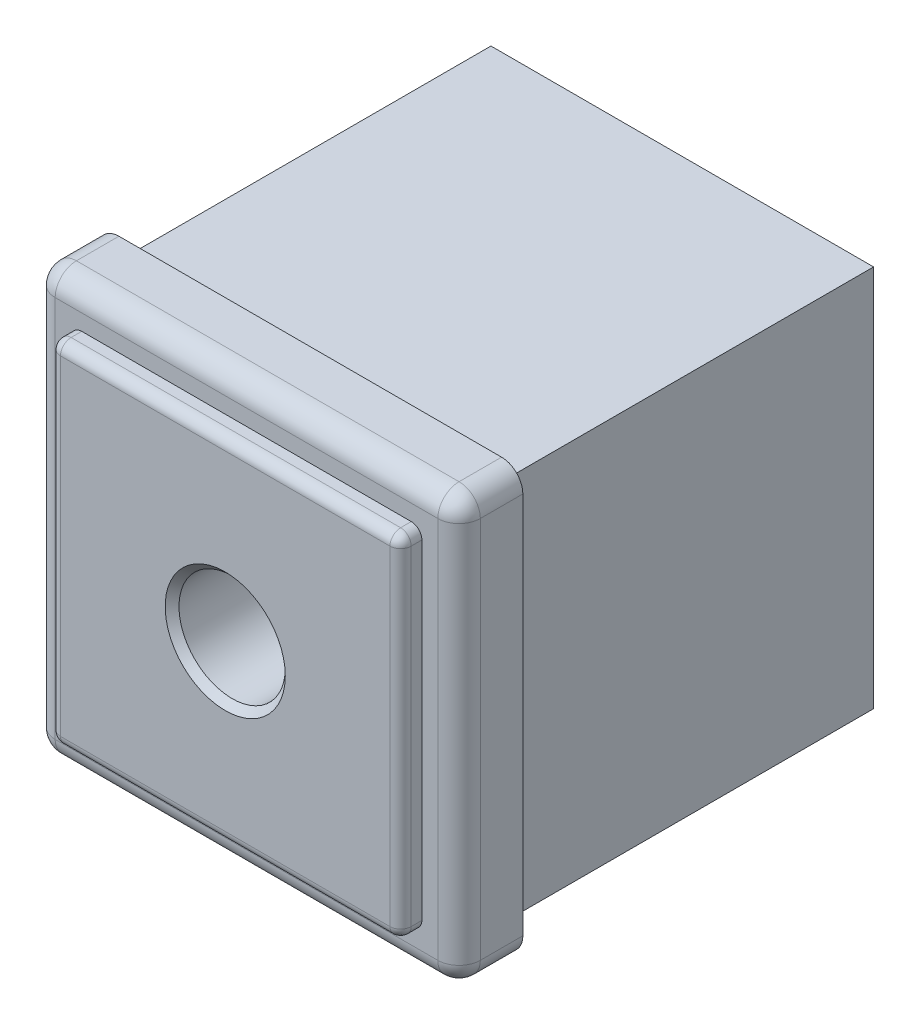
ISO-10303-21;
HEADER;
FILE_DESCRIPTION(('STEP AP214'),'2;1');
FILE_NAME('part.step','',(''),(''),'','','');
FILE_SCHEMA(('AUTOMOTIVE_DESIGN { 1 0 10303 214 1 1 1 1 }'));
ENDSEC;
DATA;
#1=APPLICATION_CONTEXT('core data for automotive mechanical design processes');
#2=APPLICATION_PROTOCOL_DEFINITION('international standard','automotive_design',2000,#1);
#3=PRODUCT_CONTEXT('',#1,'mechanical');
#4=PRODUCT('Part','Part','',(#3));
#5=PRODUCT_RELATED_PRODUCT_CATEGORY('part','',(#4));
#6=PRODUCT_DEFINITION_FORMATION('','',#4);
#7=PRODUCT_DEFINITION_CONTEXT('part definition',#1,'design');
#8=PRODUCT_DEFINITION('design','',#6,#7);
#9=PRODUCT_DEFINITION_SHAPE('','',#8);
#10=(LENGTH_UNIT() NAMED_UNIT(*) SI_UNIT(.MILLI.,.METRE.));
#11=(NAMED_UNIT(*) PLANE_ANGLE_UNIT() SI_UNIT($,.RADIAN.));
#12=(NAMED_UNIT(*) SI_UNIT($,.STERADIAN.) SOLID_ANGLE_UNIT());
#13=UNCERTAINTY_MEASURE_WITH_UNIT(LENGTH_MEASURE(1.E-05),#10,'distance_accuracy_value','');
#14=(GEOMETRIC_REPRESENTATION_CONTEXT(3) GLOBAL_UNCERTAINTY_ASSIGNED_CONTEXT((#13)) GLOBAL_UNIT_ASSIGNED_CONTEXT((#10,
#11,#12)) REPRESENTATION_CONTEXT('',''));
#15=CARTESIAN_POINT('',(0.,0.,0.));
#16=DIRECTION('',(0.,0.,1.));
#17=DIRECTION('',(1.,0.,0.));
#18=AXIS2_PLACEMENT_3D('',#15,#16,#17);
#19=CARTESIAN_POINT('',(20.,-20.,6.));
#20=DIRECTION('',(0.,0.,1.));
#21=DIRECTION('',(1.,0.,0.));
#22=AXIS2_PLACEMENT_3D('',#19,#20,#21);
#23=PLANE('',#22);
#24=DIRECTION('',(0.,1.,0.));
#25=VECTOR('',#24,1.);
#26=CARTESIAN_POINT('',(18.,18.,6.));
#27=LINE('',#26,#25);
#28=CARTESIAN_POINT('',(18.,-18.,6.));
#29=VERTEX_POINT('',#28);
#30=CARTESIAN_POINT('',(18.,18.,6.));
#31=VERTEX_POINT('',#30);
#32=EDGE_CURVE('E344',#29,#31,#27,.T.);
#33=ORIENTED_EDGE('',*,*,#32,.T.);
#34=DIRECTION('',(-1.,0.,0.));
#35=VECTOR('',#34,1.);
#36=CARTESIAN_POINT('',(-18.,18.,6.));
#37=LINE('',#36,#35);
#38=CARTESIAN_POINT('',(-18.,18.,6.));
#39=VERTEX_POINT('',#38);
#40=EDGE_CURVE('E348',#31,#39,#37,.T.);
#41=ORIENTED_EDGE('',*,*,#40,.T.);
#42=DIRECTION('',(0.,-1.,0.));
#43=VECTOR('',#42,1.);
#44=CARTESIAN_POINT('',(-18.,-18.,6.));
#45=LINE('',#44,#43);
#46=CARTESIAN_POINT('',(-18.,-18.,6.));
#47=VERTEX_POINT('',#46);
#48=EDGE_CURVE('E346',#39,#47,#45,.T.);
#49=ORIENTED_EDGE('',*,*,#48,.T.);
#50=DIRECTION('',(1.,0.,0.));
#51=VECTOR('',#50,1.);
#52=CARTESIAN_POINT('',(18.,-18.,6.));
#53=LINE('',#52,#51);
#54=EDGE_CURVE('E342',#47,#29,#53,.T.);
#55=ORIENTED_EDGE('',*,*,#54,.T.);
#56=EDGE_LOOP('',(#33,#41,#49,#55));
#57=FACE_BOUND('',#56,.T.);
#58=DIRECTION('',(1.,0.,0.));
#59=VECTOR('',#58,1.);
#60=CARTESIAN_POINT('',(-16.5,-16.5,6.));
#61=LINE('',#60,#59);
#62=CARTESIAN_POINT('',(-15.5,-16.5,6.));
#63=VERTEX_POINT('',#62);
#64=CARTESIAN_POINT('',(15.5,-16.5,6.));
#65=VERTEX_POINT('',#64);
#66=EDGE_CURVE('E266',#63,#65,#61,.T.);
#67=ORIENTED_EDGE('',*,*,#66,.F.);
#68=CARTESIAN_POINT('',(-15.5,-15.5,6.));
#69=DIRECTION('',(0.,0.,1.));
#70=DIRECTION('',(1.,0.,0.));
#71=AXIS2_PLACEMENT_3D('',#68,#69,#70);
#72=CIRCLE('',#71,1.);
#73=CARTESIAN_POINT('',(-16.5,-15.5,6.));
#74=VERTEX_POINT('',#73);
#75=EDGE_CURVE('E338',#63,#74,#72,.F.);
#76=ORIENTED_EDGE('',*,*,#75,.T.);
#77=DIRECTION('',(0.,-1.,0.));
#78=VECTOR('',#77,1.);
#79=CARTESIAN_POINT('',(-16.5,16.5,6.));
#80=LINE('',#79,#78);
#81=CARTESIAN_POINT('',(-16.5,15.5,6.));
#82=VERTEX_POINT('',#81);
#83=EDGE_CURVE('E263',#82,#74,#80,.T.);
#84=ORIENTED_EDGE('',*,*,#83,.F.);
#85=CARTESIAN_POINT('',(-15.5,15.5,6.));
#86=DIRECTION('',(0.,0.,1.));
#87=DIRECTION('',(1.,0.,0.));
#88=AXIS2_PLACEMENT_3D('',#85,#86,#87);
#89=CIRCLE('',#88,1.);
#90=CARTESIAN_POINT('',(-15.5,16.5,6.));
#91=VERTEX_POINT('',#90);
#92=EDGE_CURVE('E334',#82,#91,#89,.F.);
#93=ORIENTED_EDGE('',*,*,#92,.T.);
#94=DIRECTION('',(-1.,0.,0.));
#95=VECTOR('',#94,1.);
#96=CARTESIAN_POINT('',(-16.5,16.5,6.));
#97=LINE('',#96,#95);
#98=CARTESIAN_POINT('',(15.5,16.5,6.));
#99=VERTEX_POINT('',#98);
#100=EDGE_CURVE('E272',#99,#91,#97,.T.);
#101=ORIENTED_EDGE('',*,*,#100,.F.);
#102=CARTESIAN_POINT('',(15.5,15.5,6.));
#103=DIRECTION('',(0.,0.,1.));
#104=DIRECTION('',(1.,0.,0.));
#105=AXIS2_PLACEMENT_3D('',#102,#103,#104);
#106=CIRCLE('',#105,1.);
#107=CARTESIAN_POINT('',(16.5,15.5,6.));
#108=VERTEX_POINT('',#107);
#109=EDGE_CURVE('E336',#99,#108,#106,.F.);
#110=ORIENTED_EDGE('',*,*,#109,.T.);
#111=DIRECTION('',(0.,1.,0.));
#112=VECTOR('',#111,1.);
#113=CARTESIAN_POINT('',(16.5,16.5,6.));
#114=LINE('',#113,#112);
#115=CARTESIAN_POINT('',(16.5,-15.5,6.));
#116=VERTEX_POINT('',#115);
#117=EDGE_CURVE('E269',#116,#108,#114,.T.);
#118=ORIENTED_EDGE('',*,*,#117,.F.);
#119=CARTESIAN_POINT('',(15.5,-15.5,6.));
#120=DIRECTION('',(0.,0.,1.));
#121=DIRECTION('',(1.,0.,0.));
#122=AXIS2_PLACEMENT_3D('',#119,#120,#121);
#123=CIRCLE('',#122,1.);
#124=EDGE_CURVE('E340',#116,#65,#123,.F.);
#125=ORIENTED_EDGE('',*,*,#124,.T.);
#126=EDGE_LOOP('',(#67,#76,#84,#93,#101,#110,#118,#125));
#127=FACE_BOUND('',#126,.T.);
#128=ADVANCED_FACE('F14',(#57,#127),#23,.T.);
#129=CARTESIAN_POINT('',(-18.25,-18.25,-35.));
#130=DIRECTION('',(0.,0.,1.));
#131=DIRECTION('',(1.,0.,0.));
#132=AXIS2_PLACEMENT_3D('',#129,#130,#131);
#133=PLANE('',#132);
#134=DIRECTION('',(0.,1.,0.));
#135=VECTOR('',#134,1.);
#136=CARTESIAN_POINT('',(-18.,-18.,-35.));
#137=LINE('',#136,#135);
#138=CARTESIAN_POINT('',(-18.,-18.,-35.));
#139=VERTEX_POINT('',#138);
#140=CARTESIAN_POINT('',(-18.,18.,-35.));
#141=VERTEX_POINT('',#140);
#142=EDGE_CURVE('E198',#139,#141,#137,.T.);
#143=ORIENTED_EDGE('',*,*,#142,.T.);
#144=DIRECTION('',(1.,0.,0.));
#145=VECTOR('',#144,1.);
#146=CARTESIAN_POINT('',(-18.,18.,-35.));
#147=LINE('',#146,#145);
#148=CARTESIAN_POINT('',(18.,18.,-35.));
#149=VERTEX_POINT('',#148);
#150=EDGE_CURVE('E29',#141,#149,#147,.T.);
#151=ORIENTED_EDGE('',*,*,#150,.T.);
#152=DIRECTION('',(0.,-1.,0.));
#153=VECTOR('',#152,1.);
#154=CARTESIAN_POINT('',(18.,18.,-35.));
#155=LINE('',#154,#153);
#156=CARTESIAN_POINT('',(18.,-18.,-35.));
#157=VERTEX_POINT('',#156);
#158=EDGE_CURVE('E187',#149,#157,#155,.T.);
#159=ORIENTED_EDGE('',*,*,#158,.T.);
#160=DIRECTION('',(-1.,0.,0.));
#161=VECTOR('',#160,1.);
#162=CARTESIAN_POINT('',(18.,-18.,-35.));
#163=LINE('',#162,#161);
#164=EDGE_CURVE('E192',#157,#139,#163,.T.);
#165=ORIENTED_EDGE('',*,*,#164,.T.);
#166=EDGE_LOOP('',(#143,#151,#159,#165));
#167=FACE_BOUND('',#166,.T.);
#168=CARTESIAN_POINT('',(0.,0.,-35.));
#169=DIRECTION('',(0.,0.,1.));
#170=DIRECTION('',(1.,0.,0.));
#171=AXIS2_PLACEMENT_3D('',#168,#169,#170);
#172=CIRCLE('',#171,5.);
#173=CARTESIAN_POINT('',(5.,0.,-35.));
#174=VERTEX_POINT('',#173);
#175=EDGE_CURVE('E183',#174,#174,#172,.T.);
#176=ORIENTED_EDGE('',*,*,#175,.T.);
#177=EDGE_LOOP('',(#176));
#178=FACE_BOUND('',#177,.T.);
#179=ADVANCED_FACE('F195',(#167,#178),#133,.F.);
#180=CARTESIAN_POINT('',(20.,-20.,0.));
#181=DIRECTION('',(0.,0.,1.));
#182=DIRECTION('',(1.,0.,0.));
#183=AXIS2_PLACEMENT_3D('',#180,#181,#182);
#184=PLANE('',#183);
#185=DIRECTION('',(-1.,0.,0.));
#186=VECTOR('',#185,1.);
#187=CARTESIAN_POINT('',(-20.,20.,0.));
#188=LINE('',#187,#186);
#189=CARTESIAN_POINT('',(18.,20.,0.));
#190=VERTEX_POINT('',#189);
#191=CARTESIAN_POINT('',(-18.,20.,0.));
#192=VERTEX_POINT('',#191);
#193=EDGE_CURVE('E278',#190,#192,#188,.T.);
#194=ORIENTED_EDGE('',*,*,#193,.F.);
#195=CARTESIAN_POINT('',(18.,18.,0.));
#196=DIRECTION('',(0.,0.,1.));
#197=DIRECTION('',(1.,0.,0.));
#198=AXIS2_PLACEMENT_3D('',#195,#196,#197);
#199=CIRCLE('',#198,2.);
#200=CARTESIAN_POINT('',(20.,18.,0.));
#201=VERTEX_POINT('',#200);
#202=EDGE_CURVE('E298',#190,#201,#199,.F.);
#203=ORIENTED_EDGE('',*,*,#202,.T.);
#204=DIRECTION('',(0.,1.,0.));
#205=VECTOR('',#204,1.);
#206=CARTESIAN_POINT('',(20.,20.,0.));
#207=LINE('',#206,#205);
#208=CARTESIAN_POINT('',(20.,-18.,0.));
#209=VERTEX_POINT('',#208);
#210=EDGE_CURVE('E275',#209,#201,#207,.T.);
#211=ORIENTED_EDGE('',*,*,#210,.F.);
#212=CARTESIAN_POINT('',(18.,-18.,0.));
#213=DIRECTION('',(0.,0.,1.));
#214=DIRECTION('',(1.,0.,0.));
#215=AXIS2_PLACEMENT_3D('',#212,#213,#214);
#216=CIRCLE('',#215,2.);
#217=CARTESIAN_POINT('',(18.,-20.,0.));
#218=VERTEX_POINT('',#217);
#219=EDGE_CURVE('E294',#209,#218,#216,.F.);
#220=ORIENTED_EDGE('',*,*,#219,.T.);
#221=DIRECTION('',(1.,0.,0.));
#222=VECTOR('',#221,1.);
#223=CARTESIAN_POINT('',(-20.,-20.,0.));
#224=LINE('',#223,#222);
#225=CARTESIAN_POINT('',(-18.,-20.,0.));
#226=VERTEX_POINT('',#225);
#227=EDGE_CURVE('E284',#226,#218,#224,.T.);
#228=ORIENTED_EDGE('',*,*,#227,.F.);
#229=CARTESIAN_POINT('',(-18.,-18.,0.));
#230=DIRECTION('',(0.,0.,1.));
#231=DIRECTION('',(1.,0.,0.));
#232=AXIS2_PLACEMENT_3D('',#229,#230,#231);
#233=CIRCLE('',#232,2.);
#234=CARTESIAN_POINT('',(-20.,-18.,0.));
#235=VERTEX_POINT('',#234);
#236=EDGE_CURVE('E292',#226,#235,#233,.F.);
#237=ORIENTED_EDGE('',*,*,#236,.T.);
#238=DIRECTION('',(0.,-1.,0.));
#239=VECTOR('',#238,1.);
#240=CARTESIAN_POINT('',(-20.,20.,0.));
#241=LINE('',#240,#239);
#242=CARTESIAN_POINT('',(-20.,18.,0.));
#243=VERTEX_POINT('',#242);
#244=EDGE_CURVE('E281',#243,#235,#241,.T.);
#245=ORIENTED_EDGE('',*,*,#244,.F.);
#246=CARTESIAN_POINT('',(-18.,18.,0.));
#247=DIRECTION('',(0.,0.,1.));
#248=DIRECTION('',(1.,0.,0.));
#249=AXIS2_PLACEMENT_3D('',#246,#247,#248);
#250=CIRCLE('',#249,2.);
#251=EDGE_CURVE('E296',#243,#192,#250,.F.);
#252=ORIENTED_EDGE('',*,*,#251,.T.);
#253=EDGE_LOOP('',(#194,#203,#211,#220,#228,#237,#245,#252));
#254=FACE_BOUND('',#253,.T.);
#255=DIRECTION('',(1.,0.,0.));
#256=VECTOR('',#255,1.);
#257=CARTESIAN_POINT('',(-18.,18.,0.));
#258=LINE('',#257,#256);
#259=CARTESIAN_POINT('',(-18.,18.,0.));
#260=VERTEX_POINT('',#259);
#261=CARTESIAN_POINT('',(18.,18.,0.));
#262=VERTEX_POINT('',#261);
#263=EDGE_CURVE('E180',#260,#262,#258,.T.);
#264=ORIENTED_EDGE('',*,*,#263,.F.);
#265=DIRECTION('',(0.,1.,0.));
#266=VECTOR('',#265,1.);
#267=CARTESIAN_POINT('',(-18.,-18.,0.));
#268=LINE('',#267,#266);
#269=CARTESIAN_POINT('',(-18.,-18.,0.));
#270=VERTEX_POINT('',#269);
#271=EDGE_CURVE('E199',#270,#260,#268,.T.);
#272=ORIENTED_EDGE('',*,*,#271,.F.);
#273=DIRECTION('',(-1.,0.,0.));
#274=VECTOR('',#273,1.);
#275=CARTESIAN_POINT('',(18.,-18.,0.));
#276=LINE('',#275,#274);
#277=CARTESIAN_POINT('',(18.,-18.,0.));
#278=VERTEX_POINT('',#277);
#279=EDGE_CURVE('E202',#278,#270,#276,.T.);
#280=ORIENTED_EDGE('',*,*,#279,.F.);
#281=DIRECTION('',(0.,-1.,0.));
#282=VECTOR('',#281,1.);
#283=CARTESIAN_POINT('',(18.,18.,0.));
#284=LINE('',#283,#282);
#285=EDGE_CURVE('E209',#262,#278,#284,.T.);
#286=ORIENTED_EDGE('',*,*,#285,.F.);
#287=EDGE_LOOP('',(#264,#272,#280,#286));
#288=FACE_BOUND('',#287,.T.);
#289=ADVANCED_FACE('F417',(#254,#288),#184,.F.);
#290=CARTESIAN_POINT('',(20.,20.,6.));
#291=DIRECTION('',(-1.,0.,0.));
#292=DIRECTION('',(0.,-1.,0.));
#293=AXIS2_PLACEMENT_3D('',#290,#291,#292);
#294=PLANE('',#293);
#295=DIRECTION('',(0.,0.,-1.));
#296=VECTOR('',#295,1.);
#297=CARTESIAN_POINT('',(20.,18.,6.));
#298=LINE('',#297,#296);
#299=CARTESIAN_POINT('',(20.,18.,4.));
#300=VERTEX_POINT('',#299);
#301=EDGE_CURVE('E302',#201,#300,#298,.F.);
#302=ORIENTED_EDGE('',*,*,#301,.T.);
#303=DIRECTION('',(0.,1.,0.));
#304=VECTOR('',#303,1.);
#305=CARTESIAN_POINT('',(20.,-18.,4.));
#306=LINE('',#305,#304);
#307=CARTESIAN_POINT('',(20.,-18.,4.));
#308=VERTEX_POINT('',#307);
#309=EDGE_CURVE('E360',#300,#308,#306,.F.);
#310=ORIENTED_EDGE('',*,*,#309,.T.);
#311=DIRECTION('',(0.,0.,-1.));
#312=VECTOR('',#311,1.);
#313=CARTESIAN_POINT('',(20.,-18.,6.));
#314=LINE('',#313,#312);
#315=EDGE_CURVE('E300',#308,#209,#314,.T.);
#316=ORIENTED_EDGE('',*,*,#315,.T.);
#317=ORIENTED_EDGE('',*,*,#210,.T.);
#318=EDGE_LOOP('',(#302,#310,#316,#317));
#319=FACE_BOUND('',#318,.T.);
#320=ADVANCED_FACE('F434',(#319),#294,.F.);
#321=CARTESIAN_POINT('',(-20.,20.,6.));
#322=DIRECTION('',(0.,-1.,0.));
#323=DIRECTION('',(0.,0.,-1.));
#324=AXIS2_PLACEMENT_3D('',#321,#322,#323);
#325=PLANE('',#324);
#326=DIRECTION('',(0.,0.,-1.));
#327=VECTOR('',#326,1.);
#328=CARTESIAN_POINT('',(-18.,20.,6.));
#329=LINE('',#328,#327);
#330=CARTESIAN_POINT('',(-18.,20.,4.));
#331=VERTEX_POINT('',#330);
#332=EDGE_CURVE('E287',#192,#331,#329,.F.);
#333=ORIENTED_EDGE('',*,*,#332,.T.);
#334=DIRECTION('',(-1.,0.,0.));
#335=VECTOR('',#334,1.);
#336=CARTESIAN_POINT('',(18.,20.,4.));
#337=LINE('',#336,#335);
#338=CARTESIAN_POINT('',(18.,20.,4.));
#339=VERTEX_POINT('',#338);
#340=EDGE_CURVE('E351',#331,#339,#337,.F.);
#341=ORIENTED_EDGE('',*,*,#340,.T.);
#342=DIRECTION('',(0.,0.,-1.));
#343=VECTOR('',#342,1.);
#344=CARTESIAN_POINT('',(18.,20.,6.));
#345=LINE('',#344,#343);
#346=EDGE_CURVE('E290',#339,#190,#345,.T.);
#347=ORIENTED_EDGE('',*,*,#346,.T.);
#348=ORIENTED_EDGE('',*,*,#193,.T.);
#349=EDGE_LOOP('',(#333,#341,#347,#348));
#350=FACE_BOUND('',#349,.T.);
#351=ADVANCED_FACE('F430',(#350),#325,.F.);
#352=CARTESIAN_POINT('',(-20.,20.,6.));
#353=DIRECTION('',(1.,0.,0.));
#354=DIRECTION('',(0.,0.,-1.));
#355=AXIS2_PLACEMENT_3D('',#352,#353,#354);
#356=PLANE('',#355);
#357=DIRECTION('',(0.,0.,-1.));
#358=VECTOR('',#357,1.);
#359=CARTESIAN_POINT('',(-20.,-18.,6.));
#360=LINE('',#359,#358);
#361=CARTESIAN_POINT('',(-20.,-18.,4.));
#362=VERTEX_POINT('',#361);
#363=EDGE_CURVE('E305',#235,#362,#360,.F.);
#364=ORIENTED_EDGE('',*,*,#363,.T.);
#365=DIRECTION('',(0.,-1.,0.));
#366=VECTOR('',#365,1.);
#367=CARTESIAN_POINT('',(-20.,18.,4.));
#368=LINE('',#367,#366);
#369=CARTESIAN_POINT('',(-20.,18.,4.));
#370=VERTEX_POINT('',#369);
#371=EDGE_CURVE('E358',#362,#370,#368,.F.);
#372=ORIENTED_EDGE('',*,*,#371,.T.);
#373=DIRECTION('',(0.,0.,-1.));
#374=VECTOR('',#373,1.);
#375=CARTESIAN_POINT('',(-20.,18.,6.));
#376=LINE('',#375,#374);
#377=EDGE_CURVE('E308',#370,#243,#376,.T.);
#378=ORIENTED_EDGE('',*,*,#377,.T.);
#379=ORIENTED_EDGE('',*,*,#244,.T.);
#380=EDGE_LOOP('',(#364,#372,#378,#379));
#381=FACE_BOUND('',#380,.T.);
#382=ADVANCED_FACE('F426',(#381),#356,.F.);
#383=CARTESIAN_POINT('',(-20.,-20.,6.));
#384=DIRECTION('',(0.,1.,0.));
#385=DIRECTION('',(0.,0.,1.));
#386=AXIS2_PLACEMENT_3D('',#383,#384,#385);
#387=PLANE('',#386);
#388=DIRECTION('',(0.,0.,-1.));
#389=VECTOR('',#388,1.);
#390=CARTESIAN_POINT('',(18.,-20.,6.));
#391=LINE('',#390,#389);
#392=CARTESIAN_POINT('',(18.,-20.,4.));
#393=VERTEX_POINT('',#392);
#394=EDGE_CURVE('E312',#218,#393,#391,.F.);
#395=ORIENTED_EDGE('',*,*,#394,.T.);
#396=DIRECTION('',(1.,0.,0.));
#397=VECTOR('',#396,1.);
#398=CARTESIAN_POINT('',(-18.,-20.,4.));
#399=LINE('',#398,#397);
#400=CARTESIAN_POINT('',(-18.,-20.,4.));
#401=VERTEX_POINT('',#400);
#402=EDGE_CURVE('E366',#393,#401,#399,.F.);
#403=ORIENTED_EDGE('',*,*,#402,.T.);
#404=DIRECTION('',(0.,0.,-1.));
#405=VECTOR('',#404,1.);
#406=CARTESIAN_POINT('',(-18.,-20.,6.));
#407=LINE('',#406,#405);
#408=EDGE_CURVE('E310',#401,#226,#407,.T.);
#409=ORIENTED_EDGE('',*,*,#408,.T.);
#410=ORIENTED_EDGE('',*,*,#227,.T.);
#411=EDGE_LOOP('',(#395,#403,#409,#410));
#412=FACE_BOUND('',#411,.T.);
#413=ADVANCED_FACE('F422',(#412),#387,.F.);
#414=CARTESIAN_POINT('',(-16.5,16.5,8.));
#415=DIRECTION('',(1.,0.,0.));
#416=DIRECTION('',(0.,1.,0.));
#417=AXIS2_PLACEMENT_3D('',#414,#415,#416);
#418=PLANE('',#417);
#419=DIRECTION('',(0.,0.,-1.));
#420=VECTOR('',#419,1.);
#421=CARTESIAN_POINT('',(-16.5,-15.5,8.));
#422=LINE('',#421,#420);
#423=CARTESIAN_POINT('',(-16.5,-15.5,7.));
#424=VERTEX_POINT('',#423);
#425=EDGE_CURVE('E315',#74,#424,#422,.F.);
#426=ORIENTED_EDGE('',*,*,#425,.T.);
#427=DIRECTION('',(0.,-1.,0.));
#428=VECTOR('',#427,1.);
#429=CARTESIAN_POINT('',(-16.5,15.5,7.));
#430=LINE('',#429,#428);
#431=CARTESIAN_POINT('',(-16.5,15.5,7.));
#432=VERTEX_POINT('',#431);
#433=EDGE_CURVE('E377',#424,#432,#430,.F.);
#434=ORIENTED_EDGE('',*,*,#433,.T.);
#435=DIRECTION('',(0.,0.,-1.));
#436=VECTOR('',#435,1.);
#437=CARTESIAN_POINT('',(-16.5,15.5,8.));
#438=LINE('',#437,#436);
#439=EDGE_CURVE('E318',#432,#82,#438,.T.);
#440=ORIENTED_EDGE('',*,*,#439,.T.);
#441=ORIENTED_EDGE('',*,*,#83,.T.);
#442=EDGE_LOOP('',(#426,#434,#440,#441));
#443=FACE_BOUND('',#442,.T.);
#444=ADVANCED_FACE('F425',(#443),#418,.F.);
#445=CARTESIAN_POINT('',(-16.5,-16.5,8.));
#446=DIRECTION('',(0.,1.,0.));
#447=DIRECTION('',(-1.,0.,0.));
#448=AXIS2_PLACEMENT_3D('',#445,#446,#447);
#449=PLANE('',#448);
#450=DIRECTION('',(0.,0.,-1.));
#451=VECTOR('',#450,1.);
#452=CARTESIAN_POINT('',(15.5,-16.5,8.));
#453=LINE('',#452,#451);
#454=CARTESIAN_POINT('',(15.5,-16.5,7.));
#455=VERTEX_POINT('',#454);
#456=EDGE_CURVE('E329',#65,#455,#453,.F.);
#457=ORIENTED_EDGE('',*,*,#456,.T.);
#458=DIRECTION('',(1.,0.,0.));
#459=VECTOR('',#458,1.);
#460=CARTESIAN_POINT('',(-15.5,-16.5,7.));
#461=LINE('',#460,#459);
#462=CARTESIAN_POINT('',(-15.5,-16.5,7.));
#463=VERTEX_POINT('',#462);
#464=EDGE_CURVE('E384',#455,#463,#461,.F.);
#465=ORIENTED_EDGE('',*,*,#464,.T.);
#466=DIRECTION('',(0.,0.,-1.));
#467=VECTOR('',#466,1.);
#468=CARTESIAN_POINT('',(-15.5,-16.5,8.));
#469=LINE('',#468,#467);
#470=EDGE_CURVE('E332',#463,#63,#469,.T.);
#471=ORIENTED_EDGE('',*,*,#470,.T.);
#472=ORIENTED_EDGE('',*,*,#66,.T.);
#473=EDGE_LOOP('',(#457,#465,#471,#472));
#474=FACE_BOUND('',#473,.T.);
#475=ADVANCED_FACE('F526',(#474),#449,.F.);
#476=CARTESIAN_POINT('',(16.5,16.5,8.));
#477=DIRECTION('',(-1.,0.,0.));
#478=DIRECTION('',(0.,0.,1.));
#479=AXIS2_PLACEMENT_3D('',#476,#477,#478);
#480=PLANE('',#479);
#481=DIRECTION('',(0.,0.,-1.));
#482=VECTOR('',#481,1.);
#483=CARTESIAN_POINT('',(16.5,15.5,8.));
#484=LINE('',#483,#482);
#485=CARTESIAN_POINT('',(16.5,15.5,7.));
#486=VERTEX_POINT('',#485);
#487=EDGE_CURVE('E327',#108,#486,#484,.F.);
#488=ORIENTED_EDGE('',*,*,#487,.T.);
#489=DIRECTION('',(0.,1.,0.));
#490=VECTOR('',#489,1.);
#491=CARTESIAN_POINT('',(16.5,-15.5,7.));
#492=LINE('',#491,#490);
#493=CARTESIAN_POINT('',(16.5,-15.5,7.));
#494=VERTEX_POINT('',#493);
#495=EDGE_CURVE('E391',#486,#494,#492,.F.);
#496=ORIENTED_EDGE('',*,*,#495,.T.);
#497=DIRECTION('',(0.,0.,-1.));
#498=VECTOR('',#497,1.);
#499=CARTESIAN_POINT('',(16.5,-15.5,8.));
#500=LINE('',#499,#498);
#501=EDGE_CURVE('E325',#494,#116,#500,.T.);
#502=ORIENTED_EDGE('',*,*,#501,.T.);
#503=ORIENTED_EDGE('',*,*,#117,.T.);
#504=EDGE_LOOP('',(#488,#496,#502,#503));
#505=FACE_BOUND('',#504,.T.);
#506=ADVANCED_FACE('F522',(#505),#480,.F.);
#507=CARTESIAN_POINT('',(-16.5,16.5,8.));
#508=DIRECTION('',(0.,-1.,0.));
#509=DIRECTION('',(1.,0.,0.));
#510=AXIS2_PLACEMENT_3D('',#507,#508,#509);
#511=PLANE('',#510);
#512=DIRECTION('',(0.,0.,-1.));
#513=VECTOR('',#512,1.);
#514=CARTESIAN_POINT('',(-15.5,16.5,8.));
#515=LINE('',#514,#513);
#516=CARTESIAN_POINT('',(-15.5,16.5,7.));
#517=VERTEX_POINT('',#516);
#518=EDGE_CURVE('E322',#91,#517,#515,.F.);
#519=ORIENTED_EDGE('',*,*,#518,.T.);
#520=DIRECTION('',(-1.,0.,0.));
#521=VECTOR('',#520,1.);
#522=CARTESIAN_POINT('',(15.5,16.5,7.));
#523=LINE('',#522,#521);
#524=CARTESIAN_POINT('',(15.5,16.5,7.));
#525=VERTEX_POINT('',#524);
#526=EDGE_CURVE('E386',#517,#525,#523,.F.);
#527=ORIENTED_EDGE('',*,*,#526,.T.);
#528=DIRECTION('',(0.,0.,-1.));
#529=VECTOR('',#528,1.);
#530=CARTESIAN_POINT('',(15.5,16.5,8.));
#531=LINE('',#530,#529);
#532=EDGE_CURVE('E320',#525,#99,#531,.T.);
#533=ORIENTED_EDGE('',*,*,#532,.T.);
#534=ORIENTED_EDGE('',*,*,#100,.T.);
#535=EDGE_LOOP('',(#519,#527,#533,#534));
#536=FACE_BOUND('',#535,.T.);
#537=ADVANCED_FACE('F518',(#536),#511,.F.);
#538=CARTESIAN_POINT('',(-16.5,-16.5,8.));
#539=DIRECTION('',(0.,0.,1.));
#540=DIRECTION('',(1.,0.,0.));
#541=AXIS2_PLACEMENT_3D('',#538,#539,#540);
#542=PLANE('',#541);
#543=CARTESIAN_POINT('',(0.,0.,8.));
#544=DIRECTION('',(0.,0.,1.));
#545=DIRECTION('',(1.,0.,0.));
#546=AXIS2_PLACEMENT_3D('',#543,#544,#545);
#547=CIRCLE('',#546,5.65);
#548=CARTESIAN_POINT('',(5.65,0.,8.));
#549=VERTEX_POINT('',#548);
#550=EDGE_CURVE('E9',#549,#549,#547,.F.);
#551=ORIENTED_EDGE('',*,*,#550,.T.);
#552=EDGE_LOOP('',(#551));
#553=FACE_BOUND('',#552,.T.);
#554=DIRECTION('',(-1.,0.,0.));
#555=VECTOR('',#554,1.);
#556=CARTESIAN_POINT('',(-15.5,15.5,8.));
#557=LINE('',#556,#555);
#558=CARTESIAN_POINT('',(15.5,15.5,8.));
#559=VERTEX_POINT('',#558);
#560=CARTESIAN_POINT('',(-15.5,15.5,8.));
#561=VERTEX_POINT('',#560);
#562=EDGE_CURVE('E370',#559,#561,#557,.T.);
#563=ORIENTED_EDGE('',*,*,#562,.T.);
#564=DIRECTION('',(0.,-1.,0.));
#565=VECTOR('',#564,1.);
#566=CARTESIAN_POINT('',(-15.5,-15.5,8.));
#567=LINE('',#566,#565);
#568=CARTESIAN_POINT('',(-15.5,-15.5,8.));
#569=VERTEX_POINT('',#568);
#570=EDGE_CURVE('E374',#561,#569,#567,.T.);
#571=ORIENTED_EDGE('',*,*,#570,.T.);
#572=DIRECTION('',(1.,0.,0.));
#573=VECTOR('',#572,1.);
#574=CARTESIAN_POINT('',(15.5,-15.5,8.));
#575=LINE('',#574,#573);
#576=CARTESIAN_POINT('',(15.5,-15.5,8.));
#577=VERTEX_POINT('',#576);
#578=EDGE_CURVE('E372',#569,#577,#575,.T.);
#579=ORIENTED_EDGE('',*,*,#578,.T.);
#580=DIRECTION('',(0.,1.,0.));
#581=VECTOR('',#580,1.);
#582=CARTESIAN_POINT('',(15.5,15.5,8.));
#583=LINE('',#582,#581);
#584=EDGE_CURVE('E368',#577,#559,#583,.T.);
#585=ORIENTED_EDGE('',*,*,#584,.T.);
#586=EDGE_LOOP('',(#563,#571,#579,#585));
#587=FACE_BOUND('',#586,.T.);
#588=ADVANCED_FACE('F512',(#553,#587),#542,.T.);
#589=CARTESIAN_POINT('',(18.,18.,6.));
#590=DIRECTION('',(0.,0.,-1.));
#591=DIRECTION('',(-1.,0.,0.));
#592=AXIS2_PLACEMENT_3D('',#589,#590,#591);
#593=CYLINDRICAL_SURFACE('',#592,2.);
#594=ORIENTED_EDGE('',*,*,#346,.F.);
#595=CARTESIAN_POINT('',(18.,18.,4.));
#596=DIRECTION('',(0.,0.,-1.));
#597=DIRECTION('',(-1.,0.,0.));
#598=AXIS2_PLACEMENT_3D('',#595,#596,#597);
#599=CIRCLE('',#598,2.);
#600=EDGE_CURVE('E356',#339,#300,#599,.T.);
#601=ORIENTED_EDGE('',*,*,#600,.T.);
#602=ORIENTED_EDGE('',*,*,#301,.F.);
#603=ORIENTED_EDGE('',*,*,#202,.F.);
#604=EDGE_LOOP('',(#594,#601,#602,#603));
#605=FACE_BOUND('',#604,.T.);
#606=ADVANCED_FACE('F484',(#605),#593,.T.);
#607=CARTESIAN_POINT('',(-18.,18.,6.));
#608=DIRECTION('',(0.,0.,-1.));
#609=DIRECTION('',(-1.,0.,0.));
#610=AXIS2_PLACEMENT_3D('',#607,#608,#609);
#611=CYLINDRICAL_SURFACE('',#610,2.);
#612=ORIENTED_EDGE('',*,*,#377,.F.);
#613=CARTESIAN_POINT('',(-18.,18.,4.));
#614=DIRECTION('',(0.,0.,-1.));
#615=DIRECTION('',(-1.,0.,0.));
#616=AXIS2_PLACEMENT_3D('',#613,#614,#615);
#617=CIRCLE('',#616,2.);
#618=EDGE_CURVE('E354',#370,#331,#617,.T.);
#619=ORIENTED_EDGE('',*,*,#618,.T.);
#620=ORIENTED_EDGE('',*,*,#332,.F.);
#621=ORIENTED_EDGE('',*,*,#251,.F.);
#622=EDGE_LOOP('',(#612,#619,#620,#621));
#623=FACE_BOUND('',#622,.T.);
#624=ADVANCED_FACE('F503',(#623),#611,.T.);
#625=CARTESIAN_POINT('',(18.,-18.,6.));
#626=DIRECTION('',(0.,0.,-1.));
#627=DIRECTION('',(-1.,0.,0.));
#628=AXIS2_PLACEMENT_3D('',#625,#626,#627);
#629=CYLINDRICAL_SURFACE('',#628,2.);
#630=ORIENTED_EDGE('',*,*,#315,.F.);
#631=CARTESIAN_POINT('',(18.,-18.,4.));
#632=DIRECTION('',(0.,0.,-1.));
#633=DIRECTION('',(-1.,0.,0.));
#634=AXIS2_PLACEMENT_3D('',#631,#632,#633);
#635=CIRCLE('',#634,2.);
#636=EDGE_CURVE('E364',#308,#393,#635,.T.);
#637=ORIENTED_EDGE('',*,*,#636,.T.);
#638=ORIENTED_EDGE('',*,*,#394,.F.);
#639=ORIENTED_EDGE('',*,*,#219,.F.);
#640=EDGE_LOOP('',(#630,#637,#638,#639));
#641=FACE_BOUND('',#640,.T.);
#642=ADVANCED_FACE('F475',(#641),#629,.T.);
#643=CARTESIAN_POINT('',(-18.,-18.,6.));
#644=DIRECTION('',(0.,0.,-1.));
#645=DIRECTION('',(-1.,0.,0.));
#646=AXIS2_PLACEMENT_3D('',#643,#644,#645);
#647=CYLINDRICAL_SURFACE('',#646,2.);
#648=ORIENTED_EDGE('',*,*,#408,.F.);
#649=CARTESIAN_POINT('',(-18.,-18.,4.));
#650=DIRECTION('',(0.,0.,-1.));
#651=DIRECTION('',(-1.,0.,0.));
#652=AXIS2_PLACEMENT_3D('',#649,#650,#651);
#653=CIRCLE('',#652,2.);
#654=EDGE_CURVE('E362',#401,#362,#653,.T.);
#655=ORIENTED_EDGE('',*,*,#654,.T.);
#656=ORIENTED_EDGE('',*,*,#363,.F.);
#657=ORIENTED_EDGE('',*,*,#236,.F.);
#658=EDGE_LOOP('',(#648,#655,#656,#657));
#659=FACE_BOUND('',#658,.T.);
#660=ADVANCED_FACE('F499',(#659),#647,.T.);
#661=CARTESIAN_POINT('',(-15.5,15.5,8.));
#662=DIRECTION('',(0.,0.,-1.));
#663=DIRECTION('',(-1.,0.,0.));
#664=AXIS2_PLACEMENT_3D('',#661,#662,#663);
#665=CYLINDRICAL_SURFACE('',#664,1.);
#666=ORIENTED_EDGE('',*,*,#439,.F.);
#667=CARTESIAN_POINT('',(-15.5,15.5,7.));
#668=DIRECTION('',(0.,0.,-1.));
#669=DIRECTION('',(-1.,0.,0.));
#670=AXIS2_PLACEMENT_3D('',#667,#668,#669);
#671=CIRCLE('',#670,1.);
#672=EDGE_CURVE('E382',#432,#517,#671,.T.);
#673=ORIENTED_EDGE('',*,*,#672,.T.);
#674=ORIENTED_EDGE('',*,*,#518,.F.);
#675=ORIENTED_EDGE('',*,*,#92,.F.);
#676=EDGE_LOOP('',(#666,#673,#674,#675));
#677=FACE_BOUND('',#676,.T.);
#678=ADVANCED_FACE('F567',(#677),#665,.T.);
#679=CARTESIAN_POINT('',(15.5,15.5,8.));
#680=DIRECTION('',(0.,0.,-1.));
#681=DIRECTION('',(-1.,0.,0.));
#682=AXIS2_PLACEMENT_3D('',#679,#680,#681);
#683=CYLINDRICAL_SURFACE('',#682,1.);
#684=ORIENTED_EDGE('',*,*,#532,.F.);
#685=CARTESIAN_POINT('',(15.5,15.5,7.));
#686=DIRECTION('',(0.,0.,-1.));
#687=DIRECTION('',(-1.,0.,0.));
#688=AXIS2_PLACEMENT_3D('',#685,#686,#687);
#689=CIRCLE('',#688,1.);
#690=EDGE_CURVE('E37',#525,#486,#689,.T.);
#691=ORIENTED_EDGE('',*,*,#690,.T.);
#692=ORIENTED_EDGE('',*,*,#487,.F.);
#693=ORIENTED_EDGE('',*,*,#109,.F.);
#694=EDGE_LOOP('',(#684,#691,#692,#693));
#695=FACE_BOUND('',#694,.T.);
#696=ADVANCED_FACE('F620',(#695),#683,.T.);
#697=CARTESIAN_POINT('',(-15.5,-15.5,8.));
#698=DIRECTION('',(0.,0.,-1.));
#699=DIRECTION('',(-1.,0.,0.));
#700=AXIS2_PLACEMENT_3D('',#697,#698,#699);
#701=CYLINDRICAL_SURFACE('',#700,1.);
#702=ORIENTED_EDGE('',*,*,#470,.F.);
#703=CARTESIAN_POINT('',(-15.5,-15.5,7.));
#704=DIRECTION('',(0.,0.,-1.));
#705=DIRECTION('',(-1.,0.,0.));
#706=AXIS2_PLACEMENT_3D('',#703,#704,#705);
#707=CIRCLE('',#706,1.);
#708=EDGE_CURVE('E380',#463,#424,#707,.T.);
#709=ORIENTED_EDGE('',*,*,#708,.T.);
#710=ORIENTED_EDGE('',*,*,#425,.F.);
#711=ORIENTED_EDGE('',*,*,#75,.F.);
#712=EDGE_LOOP('',(#702,#709,#710,#711));
#713=FACE_BOUND('',#712,.T.);
#714=ADVANCED_FACE('F574',(#713),#701,.T.);
#715=CARTESIAN_POINT('',(15.5,-15.5,8.));
#716=DIRECTION('',(0.,0.,-1.));
#717=DIRECTION('',(-1.,0.,0.));
#718=AXIS2_PLACEMENT_3D('',#715,#716,#717);
#719=CYLINDRICAL_SURFACE('',#718,1.);
#720=ORIENTED_EDGE('',*,*,#501,.F.);
#721=CARTESIAN_POINT('',(15.5,-15.5,7.));
#722=DIRECTION('',(0.,0.,-1.));
#723=DIRECTION('',(-1.,0.,0.));
#724=AXIS2_PLACEMENT_3D('',#721,#722,#723);
#725=CIRCLE('',#724,1.);
#726=EDGE_CURVE('E388',#494,#455,#725,.T.);
#727=ORIENTED_EDGE('',*,*,#726,.T.);
#728=ORIENTED_EDGE('',*,*,#456,.F.);
#729=ORIENTED_EDGE('',*,*,#124,.F.);
#730=EDGE_LOOP('',(#720,#727,#728,#729));
#731=FACE_BOUND('',#730,.T.);
#732=ADVANCED_FACE('F615',(#731),#719,.T.);
#733=CARTESIAN_POINT('',(20.,-18.,4.));
#734=DIRECTION('',(-1.,0.,0.));
#735=DIRECTION('',(0.,0.,1.));
#736=AXIS2_PLACEMENT_3D('',#733,#734,#735);
#737=CYLINDRICAL_SURFACE('',#736,2.);
#738=CARTESIAN_POINT('',(-18.,-18.,4.));
#739=DIRECTION('',(-1.,0.,0.));
#740=DIRECTION('',(0.,0.,1.));
#741=AXIS2_PLACEMENT_3D('',#738,#739,#740);
#742=CIRCLE('',#741,2.);
#743=EDGE_CURVE('E257',#401,#47,#742,.T.);
#744=ORIENTED_EDGE('',*,*,#743,.F.);
#745=ORIENTED_EDGE('',*,*,#402,.F.);
#746=CARTESIAN_POINT('',(18.,-18.,4.));
#747=DIRECTION('',(1.,0.,0.));
#748=DIRECTION('',(0.,0.,-1.));
#749=AXIS2_PLACEMENT_3D('',#746,#747,#748);
#750=CIRCLE('',#749,2.);
#751=EDGE_CURVE('E260',#29,#393,#750,.T.);
#752=ORIENTED_EDGE('',*,*,#751,.F.);
#753=ORIENTED_EDGE('',*,*,#54,.F.);
#754=EDGE_LOOP('',(#744,#745,#752,#753));
#755=FACE_BOUND('',#754,.T.);
#756=ADVANCED_FACE('F469',(#755),#737,.T.);
#757=CARTESIAN_POINT('',(18.,-18.,4.));
#758=DIRECTION('',(0.,0.,1.));
#759=DIRECTION('',(1.,0.,0.));
#760=AXIS2_PLACEMENT_3D('',#757,#758,#759);
#761=SPHERICAL_SURFACE('',#760,2.);
#762=ORIENTED_EDGE('',*,*,#751,.T.);
#763=ORIENTED_EDGE('',*,*,#636,.F.);
#764=CARTESIAN_POINT('',(18.,-18.,4.));
#765=DIRECTION('',(0.,1.,0.));
#766=DIRECTION('',(0.,0.,1.));
#767=AXIS2_PLACEMENT_3D('',#764,#765,#766);
#768=CIRCLE('',#767,2.);
#769=EDGE_CURVE('E254',#29,#308,#768,.T.);
#770=ORIENTED_EDGE('',*,*,#769,.F.);
#771=EDGE_LOOP('',(#762,#763,#770));
#772=FACE_BOUND('',#771,.T.);
#773=ADVANCED_FACE('F472',(#772),#761,.T.);
#774=CARTESIAN_POINT('',(-18.,-18.,4.));
#775=DIRECTION('',(0.,0.,1.));
#776=DIRECTION('',(1.,0.,0.));
#777=AXIS2_PLACEMENT_3D('',#774,#775,#776);
#778=SPHERICAL_SURFACE('',#777,2.);
#779=ORIENTED_EDGE('',*,*,#654,.F.);
#780=ORIENTED_EDGE('',*,*,#743,.T.);
#781=CARTESIAN_POINT('',(-18.,-18.,4.));
#782=DIRECTION('',(0.,1.,0.));
#783=DIRECTION('',(-1.,0.,0.));
#784=AXIS2_PLACEMENT_3D('',#781,#782,#783);
#785=CIRCLE('',#784,2.);
#786=EDGE_CURVE('E251',#362,#47,#785,.T.);
#787=ORIENTED_EDGE('',*,*,#786,.F.);
#788=EDGE_LOOP('',(#779,#780,#787));
#789=FACE_BOUND('',#788,.T.);
#790=ADVANCED_FACE('F496',(#789),#778,.T.);
#791=CARTESIAN_POINT('',(18.,-20.,4.));
#792=DIRECTION('',(0.,-1.,0.));
#793=DIRECTION('',(1.,0.,0.));
#794=AXIS2_PLACEMENT_3D('',#791,#792,#793);
#795=CYLINDRICAL_SURFACE('',#794,2.);
#796=ORIENTED_EDGE('',*,*,#769,.T.);
#797=ORIENTED_EDGE('',*,*,#309,.F.);
#798=CARTESIAN_POINT('',(18.,18.,4.));
#799=DIRECTION('',(0.,1.,0.));
#800=DIRECTION('',(0.,0.,1.));
#801=AXIS2_PLACEMENT_3D('',#798,#799,#800);
#802=CIRCLE('',#801,2.);
#803=EDGE_CURVE('E248',#31,#300,#802,.T.);
#804=ORIENTED_EDGE('',*,*,#803,.F.);
#805=ORIENTED_EDGE('',*,*,#32,.F.);
#806=EDGE_LOOP('',(#796,#797,#804,#805));
#807=FACE_BOUND('',#806,.T.);
#808=ADVANCED_FACE('F451',(#807),#795,.T.);
#809=CARTESIAN_POINT('',(-18.,-20.,4.));
#810=DIRECTION('',(0.,1.,0.));
#811=DIRECTION('',(0.,0.,1.));
#812=AXIS2_PLACEMENT_3D('',#809,#810,#811);
#813=CYLINDRICAL_SURFACE('',#812,2.);
#814=ORIENTED_EDGE('',*,*,#786,.T.);
#815=ORIENTED_EDGE('',*,*,#48,.F.);
#816=CARTESIAN_POINT('',(-18.,18.,4.));
#817=DIRECTION('',(0.,1.,0.));
#818=DIRECTION('',(0.,0.,1.));
#819=AXIS2_PLACEMENT_3D('',#816,#817,#818);
#820=CIRCLE('',#819,2.);
#821=EDGE_CURVE('E245',#370,#39,#820,.T.);
#822=ORIENTED_EDGE('',*,*,#821,.F.);
#823=ORIENTED_EDGE('',*,*,#371,.F.);
#824=EDGE_LOOP('',(#814,#815,#822,#823));
#825=FACE_BOUND('',#824,.T.);
#826=ADVANCED_FACE('F492',(#825),#813,.T.);
#827=CARTESIAN_POINT('',(18.,18.,4.));
#828=DIRECTION('',(0.,0.,1.));
#829=DIRECTION('',(1.,0.,0.));
#830=AXIS2_PLACEMENT_3D('',#827,#828,#829);
#831=SPHERICAL_SURFACE('',#830,2.);
#832=ORIENTED_EDGE('',*,*,#803,.T.);
#833=ORIENTED_EDGE('',*,*,#600,.F.);
#834=CARTESIAN_POINT('',(18.,18.,4.));
#835=DIRECTION('',(-1.,0.,0.));
#836=DIRECTION('',(0.,0.,1.));
#837=AXIS2_PLACEMENT_3D('',#834,#835,#836);
#838=CIRCLE('',#837,2.);
#839=EDGE_CURVE('E243',#31,#339,#838,.T.);
#840=ORIENTED_EDGE('',*,*,#839,.F.);
#841=EDGE_LOOP('',(#832,#833,#840));
#842=FACE_BOUND('',#841,.T.);
#843=ADVANCED_FACE('F457',(#842),#831,.T.);
#844=CARTESIAN_POINT('',(-18.,18.,4.));
#845=DIRECTION('',(0.,0.,1.));
#846=DIRECTION('',(1.,0.,0.));
#847=AXIS2_PLACEMENT_3D('',#844,#845,#846);
#848=SPHERICAL_SURFACE('',#847,2.);
#849=ORIENTED_EDGE('',*,*,#618,.F.);
#850=ORIENTED_EDGE('',*,*,#821,.T.);
#851=CARTESIAN_POINT('',(-18.,18.,4.));
#852=DIRECTION('',(1.,0.,0.));
#853=DIRECTION('',(0.,0.,-1.));
#854=AXIS2_PLACEMENT_3D('',#851,#852,#853);
#855=CIRCLE('',#854,2.);
#856=EDGE_CURVE('E241',#331,#39,#855,.T.);
#857=ORIENTED_EDGE('',*,*,#856,.F.);
#858=EDGE_LOOP('',(#849,#850,#857));
#859=FACE_BOUND('',#858,.T.);
#860=ADVANCED_FACE('F488',(#859),#848,.T.);
#861=CARTESIAN_POINT('',(20.,18.,4.));
#862=DIRECTION('',(1.,0.,0.));
#863=DIRECTION('',(0.,0.,-1.));
#864=AXIS2_PLACEMENT_3D('',#861,#862,#863);
#865=CYLINDRICAL_SURFACE('',#864,2.);
#866=ORIENTED_EDGE('',*,*,#839,.T.);
#867=ORIENTED_EDGE('',*,*,#340,.F.);
#868=ORIENTED_EDGE('',*,*,#856,.T.);
#869=ORIENTED_EDGE('',*,*,#40,.F.);
#870=EDGE_LOOP('',(#866,#867,#868,#869));
#871=FACE_BOUND('',#870,.T.);
#872=ADVANCED_FACE('F461',(#871),#865,.T.);
#873=CARTESIAN_POINT('',(15.5,-16.5,7.));
#874=DIRECTION('',(0.,-1.,0.));
#875=DIRECTION('',(0.,0.,-1.));
#876=AXIS2_PLACEMENT_3D('',#873,#874,#875);
#877=CYLINDRICAL_SURFACE('',#876,1.);
#878=CARTESIAN_POINT('',(15.5,-15.5,7.));
#879=DIRECTION('',(0.,-1.,0.));
#880=DIRECTION('',(0.,0.,-1.));
#881=AXIS2_PLACEMENT_3D('',#878,#879,#880);
#882=CIRCLE('',#881,1.);
#883=EDGE_CURVE('E235',#494,#577,#882,.T.);
#884=ORIENTED_EDGE('',*,*,#883,.F.);
#885=ORIENTED_EDGE('',*,*,#495,.F.);
#886=CARTESIAN_POINT('',(15.5,15.5,7.));
#887=DIRECTION('',(0.,1.,0.));
#888=DIRECTION('',(0.,0.,1.));
#889=AXIS2_PLACEMENT_3D('',#886,#887,#888);
#890=CIRCLE('',#889,1.);
#891=EDGE_CURVE('E238',#559,#486,#890,.T.);
#892=ORIENTED_EDGE('',*,*,#891,.F.);
#893=ORIENTED_EDGE('',*,*,#584,.F.);
#894=EDGE_LOOP('',(#884,#885,#892,#893));
#895=FACE_BOUND('',#894,.T.);
#896=ADVANCED_FACE('F584',(#895),#877,.T.);
#897=CARTESIAN_POINT('',(15.5,15.5,7.));
#898=DIRECTION('',(0.,0.,1.));
#899=DIRECTION('',(1.,0.,0.));
#900=AXIS2_PLACEMENT_3D('',#897,#898,#899);
#901=SPHERICAL_SURFACE('',#900,1.);
#902=ORIENTED_EDGE('',*,*,#891,.T.);
#903=ORIENTED_EDGE('',*,*,#690,.F.);
#904=CARTESIAN_POINT('',(15.5,15.5,7.));
#905=DIRECTION('',(-1.,0.,0.));
#906=DIRECTION('',(0.,0.,1.));
#907=AXIS2_PLACEMENT_3D('',#904,#905,#906);
#908=CIRCLE('',#907,1.);
#909=EDGE_CURVE('E232',#559,#525,#908,.T.);
#910=ORIENTED_EDGE('',*,*,#909,.F.);
#911=EDGE_LOOP('',(#902,#903,#910));
#912=FACE_BOUND('',#911,.T.);
#913=ADVANCED_FACE('F587',(#912),#901,.T.);
#914=CARTESIAN_POINT('',(15.5,-15.5,7.));
#915=DIRECTION('',(0.,0.,1.));
#916=DIRECTION('',(1.,0.,0.));
#917=AXIS2_PLACEMENT_3D('',#914,#915,#916);
#918=SPHERICAL_SURFACE('',#917,1.);
#919=ORIENTED_EDGE('',*,*,#726,.F.);
#920=ORIENTED_EDGE('',*,*,#883,.T.);
#921=CARTESIAN_POINT('',(15.5,-15.5,7.));
#922=DIRECTION('',(-1.,0.,0.));
#923=DIRECTION('',(0.,-1.,0.));
#924=AXIS2_PLACEMENT_3D('',#921,#922,#923);
#925=CIRCLE('',#924,1.);
#926=EDGE_CURVE('E229',#455,#577,#925,.T.);
#927=ORIENTED_EDGE('',*,*,#926,.F.);
#928=EDGE_LOOP('',(#919,#920,#927));
#929=FACE_BOUND('',#928,.T.);
#930=ADVANCED_FACE('F580',(#929),#918,.T.);
#931=CARTESIAN_POINT('',(-16.5,15.5,7.));
#932=DIRECTION('',(1.,0.,0.));
#933=DIRECTION('',(0.,1.,0.));
#934=AXIS2_PLACEMENT_3D('',#931,#932,#933);
#935=CYLINDRICAL_SURFACE('',#934,1.);
#936=ORIENTED_EDGE('',*,*,#909,.T.);
#937=ORIENTED_EDGE('',*,*,#526,.F.);
#938=CARTESIAN_POINT('',(-15.5,15.5,7.));
#939=DIRECTION('',(-1.,0.,0.));
#940=DIRECTION('',(0.,0.,1.));
#941=AXIS2_PLACEMENT_3D('',#938,#939,#940);
#942=CIRCLE('',#941,1.);
#943=EDGE_CURVE('E226',#561,#517,#942,.T.);
#944=ORIENTED_EDGE('',*,*,#943,.F.);
#945=ORIENTED_EDGE('',*,*,#562,.F.);
#946=EDGE_LOOP('',(#936,#937,#944,#945));
#947=FACE_BOUND('',#946,.T.);
#948=ADVANCED_FACE('F562',(#947),#935,.T.);
#949=CARTESIAN_POINT('',(-16.5,-15.5,7.));
#950=DIRECTION('',(-1.,0.,0.));
#951=DIRECTION('',(0.,-1.,0.));
#952=AXIS2_PLACEMENT_3D('',#949,#950,#951);
#953=CYLINDRICAL_SURFACE('',#952,1.);
#954=ORIENTED_EDGE('',*,*,#926,.T.);
#955=ORIENTED_EDGE('',*,*,#578,.F.);
#956=CARTESIAN_POINT('',(-15.5,-15.5,7.));
#957=DIRECTION('',(-1.,0.,0.));
#958=DIRECTION('',(0.,0.,1.));
#959=AXIS2_PLACEMENT_3D('',#956,#957,#958);
#960=CIRCLE('',#959,1.);
#961=EDGE_CURVE('E223',#463,#569,#960,.T.);
#962=ORIENTED_EDGE('',*,*,#961,.F.);
#963=ORIENTED_EDGE('',*,*,#464,.F.);
#964=EDGE_LOOP('',(#954,#955,#962,#963));
#965=FACE_BOUND('',#964,.T.);
#966=ADVANCED_FACE('F553',(#965),#953,.T.);
#967=CARTESIAN_POINT('',(-15.5,15.5,7.));
#968=DIRECTION('',(0.,0.,1.));
#969=DIRECTION('',(1.,0.,0.));
#970=AXIS2_PLACEMENT_3D('',#967,#968,#969);
#971=SPHERICAL_SURFACE('',#970,1.);
#972=ORIENTED_EDGE('',*,*,#943,.T.);
#973=ORIENTED_EDGE('',*,*,#672,.F.);
#974=CARTESIAN_POINT('',(-15.5,15.5,7.));
#975=DIRECTION('',(0.,-1.,0.));
#976=DIRECTION('',(0.,0.,-1.));
#977=AXIS2_PLACEMENT_3D('',#974,#975,#976);
#978=CIRCLE('',#977,1.);
#979=EDGE_CURVE('E221',#561,#432,#978,.T.);
#980=ORIENTED_EDGE('',*,*,#979,.F.);
#981=EDGE_LOOP('',(#972,#973,#980));
#982=FACE_BOUND('',#981,.T.);
#983=ADVANCED_FACE('F564',(#982),#971,.T.);
#984=CARTESIAN_POINT('',(-15.5,-15.5,7.));
#985=DIRECTION('',(0.,0.,1.));
#986=DIRECTION('',(1.,0.,0.));
#987=AXIS2_PLACEMENT_3D('',#984,#985,#986);
#988=SPHERICAL_SURFACE('',#987,1.);
#989=ORIENTED_EDGE('',*,*,#708,.F.);
#990=ORIENTED_EDGE('',*,*,#961,.T.);
#991=CARTESIAN_POINT('',(-15.5,-15.5,7.));
#992=DIRECTION('',(0.,1.,0.));
#993=DIRECTION('',(0.,0.,1.));
#994=AXIS2_PLACEMENT_3D('',#991,#992,#993);
#995=CIRCLE('',#994,1.);
#996=EDGE_CURVE('E219',#424,#569,#995,.T.);
#997=ORIENTED_EDGE('',*,*,#996,.F.);
#998=EDGE_LOOP('',(#989,#990,#997));
#999=FACE_BOUND('',#998,.T.);
#1000=ADVANCED_FACE('F548',(#999),#988,.T.);
#1001=CARTESIAN_POINT('',(-15.5,-16.5,7.));
#1002=DIRECTION('',(0.,1.,0.));
#1003=DIRECTION('',(-1.,0.,0.));
#1004=AXIS2_PLACEMENT_3D('',#1001,#1002,#1003);
#1005=CYLINDRICAL_SURFACE('',#1004,1.);
#1006=ORIENTED_EDGE('',*,*,#979,.T.);
#1007=ORIENTED_EDGE('',*,*,#433,.F.);
#1008=ORIENTED_EDGE('',*,*,#996,.T.);
#1009=ORIENTED_EDGE('',*,*,#570,.F.);
#1010=EDGE_LOOP('',(#1006,#1007,#1008,#1009));
#1011=FACE_BOUND('',#1010,.T.);
#1012=ADVANCED_FACE('F407',(#1011),#1005,.T.);
#1013=CARTESIAN_POINT('',(0.,0.,-35.));
#1014=DIRECTION('',(0.,0.,1.));
#1015=DIRECTION('',(1.,0.,0.));
#1016=AXIS2_PLACEMENT_3D('',#1013,#1014,#1015);
#1017=CYLINDRICAL_SURFACE('',#1016,5.);
#1018=CARTESIAN_POINT('',(0.,0.,7.35));
#1019=DIRECTION('',(0.,0.,1.));
#1020=DIRECTION('',(1.,0.,0.));
#1021=AXIS2_PLACEMENT_3D('',#1018,#1019,#1020);
#1022=CIRCLE('',#1021,5.);
#1023=CARTESIAN_POINT('',(5.,0.,7.35));
#1024=VERTEX_POINT('',#1023);
#1025=EDGE_CURVE('E22',#1024,#1024,#1022,.T.);
#1026=ORIENTED_EDGE('',*,*,#1025,.T.);
#1027=EDGE_LOOP('',(#1026));
#1028=FACE_BOUND('',#1027,.T.);
#1029=ORIENTED_EDGE('',*,*,#175,.F.);
#1030=EDGE_LOOP('',(#1029));
#1031=FACE_BOUND('',#1030,.T.);
#1032=ADVANCED_FACE('F395',(#1028,#1031),#1017,.F.);
#1033=CARTESIAN_POINT('',(0.,0.,7.35));
#1034=DIRECTION('',(0.,0.,1.));
#1035=DIRECTION('',(1.,0.,0.));
#1036=AXIS2_PLACEMENT_3D('',#1033,#1034,#1035);
#1037=CONICAL_SURFACE('',#1036,5.,0.785398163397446);
#1038=ORIENTED_EDGE('',*,*,#550,.F.);
#1039=EDGE_LOOP('',(#1038));
#1040=FACE_BOUND('',#1039,.T.);
#1041=ORIENTED_EDGE('',*,*,#1025,.F.);
#1042=EDGE_LOOP('',(#1041));
#1043=FACE_BOUND('',#1042,.T.);
#1044=ADVANCED_FACE('F16',(#1040,#1043),#1037,.F.);
#1045=CARTESIAN_POINT('',(-18.,18.,-35.));
#1046=DIRECTION('',(0.,-1.,0.));
#1047=DIRECTION('',(0.,0.,-1.));
#1048=AXIS2_PLACEMENT_3D('',#1045,#1046,#1047);
#1049=PLANE('',#1048);
#1050=ORIENTED_EDGE('',*,*,#263,.T.);
#1051=DIRECTION('',(0.,0.,1.));
#1052=VECTOR('',#1051,1.);
#1053=CARTESIAN_POINT('',(18.,18.,-35.));
#1054=LINE('',#1053,#1052);
#1055=EDGE_CURVE('E177',#149,#262,#1054,.T.);
#1056=ORIENTED_EDGE('',*,*,#1055,.F.);
#1057=ORIENTED_EDGE('',*,*,#150,.F.);
#1058=DIRECTION('',(0.,0.,1.));
#1059=VECTOR('',#1058,1.);
#1060=CARTESIAN_POINT('',(-18.,18.,-35.));
#1061=LINE('',#1060,#1059);
#1062=EDGE_CURVE('E207',#141,#260,#1061,.T.);
#1063=ORIENTED_EDGE('',*,*,#1062,.T.);
#1064=EDGE_LOOP('',(#1050,#1056,#1057,#1063));
#1065=FACE_BOUND('',#1064,.T.);
#1066=ADVANCED_FACE('F179',(#1065),#1049,.F.);
#1067=CARTESIAN_POINT('',(18.,18.,-35.));
#1068=DIRECTION('',(-1.,0.,0.));
#1069=DIRECTION('',(0.,0.,1.));
#1070=AXIS2_PLACEMENT_3D('',#1067,#1068,#1069);
#1071=PLANE('',#1070);
#1072=ORIENTED_EDGE('',*,*,#285,.T.);
#1073=DIRECTION('',(0.,0.,1.));
#1074=VECTOR('',#1073,1.);
#1075=CARTESIAN_POINT('',(18.,-18.,-35.));
#1076=LINE('',#1075,#1074);
#1077=EDGE_CURVE('E184',#157,#278,#1076,.T.);
#1078=ORIENTED_EDGE('',*,*,#1077,.F.);
#1079=ORIENTED_EDGE('',*,*,#158,.F.);
#1080=ORIENTED_EDGE('',*,*,#1055,.T.);
#1081=EDGE_LOOP('',(#1072,#1078,#1079,#1080));
#1082=FACE_BOUND('',#1081,.T.);
#1083=ADVANCED_FACE('F188',(#1082),#1071,.F.);
#1084=CARTESIAN_POINT('',(18.,-18.,-35.));
#1085=DIRECTION('',(0.,1.,0.));
#1086=DIRECTION('',(0.,0.,1.));
#1087=AXIS2_PLACEMENT_3D('',#1084,#1085,#1086);
#1088=PLANE('',#1087);
#1089=ORIENTED_EDGE('',*,*,#279,.T.);
#1090=DIRECTION('',(0.,0.,1.));
#1091=VECTOR('',#1090,1.);
#1092=CARTESIAN_POINT('',(-18.,-18.,-35.));
#1093=LINE('',#1092,#1091);
#1094=EDGE_CURVE('E214',#139,#270,#1093,.T.);
#1095=ORIENTED_EDGE('',*,*,#1094,.F.);
#1096=ORIENTED_EDGE('',*,*,#164,.F.);
#1097=ORIENTED_EDGE('',*,*,#1077,.T.);
#1098=EDGE_LOOP('',(#1089,#1095,#1096,#1097));
#1099=FACE_BOUND('',#1098,.T.);
#1100=ADVANCED_FACE('F816',(#1099),#1088,.F.);
#1101=CARTESIAN_POINT('',(-18.,-18.,-35.));
#1102=DIRECTION('',(1.,0.,0.));
#1103=DIRECTION('',(0.,0.,-1.));
#1104=AXIS2_PLACEMENT_3D('',#1101,#1102,#1103);
#1105=PLANE('',#1104);
#1106=ORIENTED_EDGE('',*,*,#271,.T.);
#1107=ORIENTED_EDGE('',*,*,#1062,.F.);
#1108=ORIENTED_EDGE('',*,*,#142,.F.);
#1109=ORIENTED_EDGE('',*,*,#1094,.T.);
#1110=EDGE_LOOP('',(#1106,#1107,#1108,#1109));
#1111=FACE_BOUND('',#1110,.T.);
#1112=ADVANCED_FACE('F824',(#1111),#1105,.F.);
#1113=CLOSED_SHELL('',(#128,#179,#289,#320,#351,#382,#413,#444,#475,#506,#537,#588,#606,#624,
#642,#660,#678,#696,#714,#732,#756,#773,#790,#808,#826,#843,#860,#872,#896,#913,#930,#948,#966,
#983,#1000,#1012,#1032,#1044,#1066,#1083,#1100,#1112));
#1114=MANIFOLD_SOLID_BREP('B1',#1113);
#1115=ADVANCED_BREP_SHAPE_REPRESENTATION('',(#18,#1114),#14);
#1116=SHAPE_DEFINITION_REPRESENTATION(#9,#1115);
ENDSEC;
END-ISO-10303-21;
